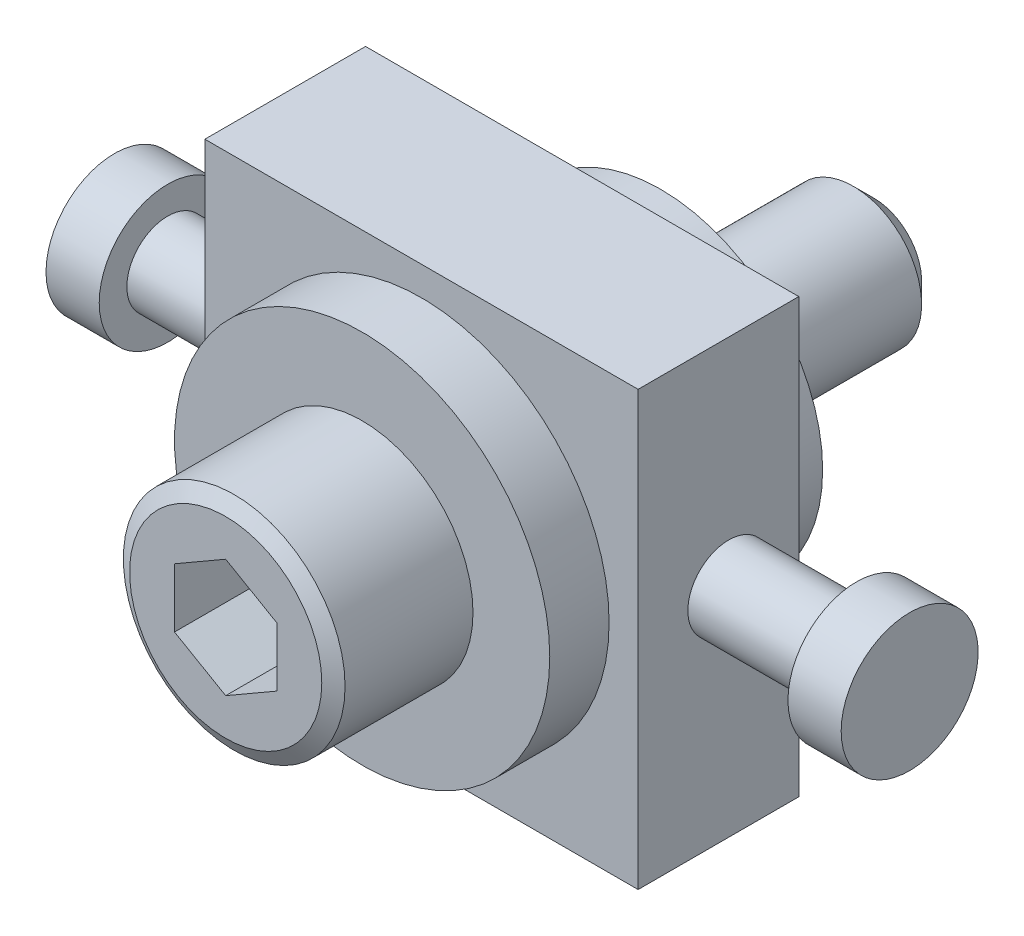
ISO-10303-21;
HEADER;
FILE_DESCRIPTION(('STEP AP214'),'2;1');
FILE_NAME('part.step','',(''),(''),'','','');
FILE_SCHEMA(('AUTOMOTIVE_DESIGN { 1 0 10303 214 1 1 1 1 }'));
ENDSEC;
DATA;
#1=APPLICATION_CONTEXT('core data for automotive mechanical design processes');
#2=APPLICATION_PROTOCOL_DEFINITION('international standard','automotive_design',2000,#1);
#3=PRODUCT_CONTEXT('',#1,'mechanical');
#4=PRODUCT('Part','Part','',(#3));
#5=PRODUCT_RELATED_PRODUCT_CATEGORY('part','',(#4));
#6=PRODUCT_DEFINITION_FORMATION('','',#4);
#7=PRODUCT_DEFINITION_CONTEXT('part definition',#1,'design');
#8=PRODUCT_DEFINITION('design','',#6,#7);
#9=PRODUCT_DEFINITION_SHAPE('','',#8);
#10=(LENGTH_UNIT() NAMED_UNIT(*) SI_UNIT(.MILLI.,.METRE.));
#11=(NAMED_UNIT(*) PLANE_ANGLE_UNIT() SI_UNIT($,.RADIAN.));
#12=(NAMED_UNIT(*) SI_UNIT($,.STERADIAN.) SOLID_ANGLE_UNIT());
#13=UNCERTAINTY_MEASURE_WITH_UNIT(LENGTH_MEASURE(1.E-05),#10,'distance_accuracy_value','');
#14=(GEOMETRIC_REPRESENTATION_CONTEXT(3) GLOBAL_UNCERTAINTY_ASSIGNED_CONTEXT((#13)) GLOBAL_UNIT_ASSIGNED_CONTEXT((#10,
#11,#12)) REPRESENTATION_CONTEXT('',''));
#15=CARTESIAN_POINT('',(0.,0.,0.));
#16=DIRECTION('',(0.,0.,1.));
#17=DIRECTION('',(1.,0.,0.));
#18=AXIS2_PLACEMENT_3D('',#15,#16,#17);
#19=CARTESIAN_POINT('',(20.19,0.,8.71));
#20=DIRECTION('',(1.,0.,0.));
#21=DIRECTION('',(0.,0.,1.));
#22=AXIS2_PLACEMENT_3D('',#19,#20,#21);
#23=PLANE('',#22);
#24=CARTESIAN_POINT('',(20.19,0.,8.71));
#25=DIRECTION('',(1.,0.,0.));
#26=DIRECTION('',(0.,1.,0.));
#27=AXIS2_PLACEMENT_3D('',#24,#25,#26);
#28=CIRCLE('',#27,2.395);
#29=CARTESIAN_POINT('',(20.19,2.395,8.71));
#30=VERTEX_POINT('',#29);
#31=EDGE_CURVE('E87',#30,#30,#28,.F.);
#32=ORIENTED_EDGE('',*,*,#31,.F.);
#33=EDGE_LOOP('',(#32));
#34=FACE_BOUND('',#33,.T.);
#35=CARTESIAN_POINT('',(20.19,0.,8.71));
#36=DIRECTION('',(1.,0.,0.));
#37=DIRECTION('',(0.,0.,1.));
#38=AXIS2_PLACEMENT_3D('',#35,#36,#37);
#39=CIRCLE('',#38,4.015);
#40=CARTESIAN_POINT('',(20.19,0.,12.725));
#41=VERTEX_POINT('',#40);
#42=EDGE_CURVE('E9',#41,#41,#39,.T.);
#43=ORIENTED_EDGE('',*,*,#42,.F.);
#44=EDGE_LOOP('',(#43));
#45=FACE_BOUND('',#44,.T.);
#46=ADVANCED_FACE('F14',(#34,#45),#23,.F.);
#47=CARTESIAN_POINT('',(20.7,0.,8.71));
#48=DIRECTION('',(-1.,0.,0.));
#49=DIRECTION('',(0.,0.,1.));
#50=AXIS2_PLACEMENT_3D('',#47,#48,#49);
#51=CYLINDRICAL_SURFACE('',#50,2.395);
#52=CARTESIAN_POINT('',(12.7,0.,8.71));
#53=DIRECTION('',(1.,0.,0.));
#54=DIRECTION('',(0.,0.,-1.));
#55=AXIS2_PLACEMENT_3D('',#52,#53,#54);
#56=CIRCLE('',#55,2.395);
#57=CARTESIAN_POINT('',(12.7,0.,6.315));
#58=VERTEX_POINT('',#57);
#59=EDGE_CURVE('E144',#58,#58,#56,.T.);
#60=ORIENTED_EDGE('',*,*,#59,.T.);
#61=EDGE_LOOP('',(#60));
#62=FACE_BOUND('',#61,.T.);
#63=ORIENTED_EDGE('',*,*,#31,.T.);
#64=EDGE_LOOP('',(#63));
#65=FACE_BOUND('',#64,.T.);
#66=ADVANCED_FACE('F171',(#62,#65),#51,.T.);
#67=CARTESIAN_POINT('',(-20.7,0.,8.71));
#68=DIRECTION('',(1.,0.,0.));
#69=DIRECTION('',(0.,0.,-1.));
#70=AXIS2_PLACEMENT_3D('',#67,#68,#69);
#71=CYLINDRICAL_SURFACE('',#70,2.395);
#72=CARTESIAN_POINT('',(-12.7,0.,8.71));
#73=DIRECTION('',(1.,0.,0.));
#74=DIRECTION('',(0.,0.,-1.));
#75=AXIS2_PLACEMENT_3D('',#72,#73,#74);
#76=CIRCLE('',#75,2.395);
#77=CARTESIAN_POINT('',(-12.7,0.,6.315));
#78=VERTEX_POINT('',#77);
#79=EDGE_CURVE('E76',#78,#78,#76,.T.);
#80=ORIENTED_EDGE('',*,*,#79,.F.);
#81=EDGE_LOOP('',(#80));
#82=FACE_BOUND('',#81,.T.);
#83=CARTESIAN_POINT('',(-20.19,0.,8.71));
#84=DIRECTION('',(-1.,0.,0.));
#85=DIRECTION('',(0.,-1.,0.));
#86=AXIS2_PLACEMENT_3D('',#83,#84,#85);
#87=CIRCLE('',#86,2.395);
#88=CARTESIAN_POINT('',(-20.19,-2.395,8.71));
#89=VERTEX_POINT('',#88);
#90=EDGE_CURVE('E134',#89,#89,#87,.T.);
#91=ORIENTED_EDGE('',*,*,#90,.F.);
#92=EDGE_LOOP('',(#91));
#93=FACE_BOUND('',#92,.T.);
#94=ADVANCED_FACE('F177',(#82,#93),#71,.T.);
#95=CARTESIAN_POINT('',(-12.7,12.7,-150.));
#96=DIRECTION('',(-1.,0.,0.));
#97=DIRECTION('',(0.,-1.,0.));
#98=AXIS2_PLACEMENT_3D('',#95,#96,#97);
#99=PLANE('',#98);
#100=DIRECTION('',(0.,-1.,0.));
#101=VECTOR('',#100,1.);
#102=CARTESIAN_POINT('',(-12.7,0.,4.6));
#103=LINE('',#102,#101);
#104=CARTESIAN_POINT('',(-12.7,12.7,4.6));
#105=VERTEX_POINT('',#104);
#106=CARTESIAN_POINT('',(-12.7,-12.7,4.6));
#107=VERTEX_POINT('',#106);
#108=EDGE_CURVE('E77',#105,#107,#103,.T.);
#109=ORIENTED_EDGE('',*,*,#108,.T.);
#110=DIRECTION('',(0.,0.,1.));
#111=VECTOR('',#110,1.);
#112=CARTESIAN_POINT('',(-12.7,-12.7,-150.));
#113=LINE('',#112,#111);
#114=CARTESIAN_POINT('',(-12.7,-12.7,14.02));
#115=VERTEX_POINT('',#114);
#116=EDGE_CURVE('E66',#107,#115,#113,.T.);
#117=ORIENTED_EDGE('',*,*,#116,.T.);
#118=DIRECTION('',(0.,-1.,0.));
#119=VECTOR('',#118,1.);
#120=CARTESIAN_POINT('',(-12.7,0.,14.02));
#121=LINE('',#120,#119);
#122=CARTESIAN_POINT('',(-12.7,12.7,14.02));
#123=VERTEX_POINT('',#122);
#124=EDGE_CURVE('E118',#123,#115,#121,.T.);
#125=ORIENTED_EDGE('',*,*,#124,.F.);
#126=DIRECTION('',(0.,0.,1.));
#127=VECTOR('',#126,1.);
#128=CARTESIAN_POINT('',(-12.7,12.7,-150.));
#129=LINE('',#128,#127);
#130=EDGE_CURVE('E84',#105,#123,#129,.T.);
#131=ORIENTED_EDGE('',*,*,#130,.F.);
#132=EDGE_LOOP('',(#109,#117,#125,#131));
#133=FACE_BOUND('',#132,.T.);
#134=ORIENTED_EDGE('',*,*,#79,.T.);
#135=EDGE_LOOP('',(#134));
#136=FACE_BOUND('',#135,.T.);
#137=ADVANCED_FACE('F81',(#133,#136),#99,.T.);
#138=CARTESIAN_POINT('',(0.,0.,4.6));
#139=DIRECTION('',(0.,0.,1.));
#140=DIRECTION('',(1.,0.,0.));
#141=AXIS2_PLACEMENT_3D('',#138,#139,#140);
#142=PLANE('',#141);
#143=CARTESIAN_POINT('',(0.,0.,4.6));
#144=DIRECTION('',(0.,0.,1.));
#145=DIRECTION('',(1.,0.,0.));
#146=AXIS2_PLACEMENT_3D('',#143,#144,#145);
#147=CIRCLE('',#146,9.5);
#148=CARTESIAN_POINT('',(9.5,0.,4.6));
#149=VERTEX_POINT('',#148);
#150=EDGE_CURVE('E98',#149,#149,#147,.T.);
#151=ORIENTED_EDGE('',*,*,#150,.T.);
#152=EDGE_LOOP('',(#151));
#153=FACE_BOUND('',#152,.T.);
#154=ORIENTED_EDGE('',*,*,#108,.F.);
#155=DIRECTION('',(1.,0.,0.));
#156=VECTOR('',#155,1.);
#157=CARTESIAN_POINT('',(0.,12.7,4.6));
#158=LINE('',#157,#156);
#159=CARTESIAN_POINT('',(12.7,12.7,4.6));
#160=VERTEX_POINT('',#159);
#161=EDGE_CURVE('E93',#105,#160,#158,.T.);
#162=ORIENTED_EDGE('',*,*,#161,.T.);
#163=DIRECTION('',(0.,1.,0.));
#164=VECTOR('',#163,1.);
#165=CARTESIAN_POINT('',(12.7,0.,4.6));
#166=LINE('',#165,#164);
#167=CARTESIAN_POINT('',(12.7,-12.7,4.6));
#168=VERTEX_POINT('',#167);
#169=EDGE_CURVE('E91',#168,#160,#166,.T.);
#170=ORIENTED_EDGE('',*,*,#169,.F.);
#171=DIRECTION('',(-1.,0.,0.));
#172=VECTOR('',#171,1.);
#173=CARTESIAN_POINT('',(0.,-12.7,4.6));
#174=LINE('',#173,#172);
#175=EDGE_CURVE('E70',#168,#107,#174,.T.);
#176=ORIENTED_EDGE('',*,*,#175,.T.);
#177=EDGE_LOOP('',(#154,#162,#170,#176));
#178=FACE_BOUND('',#177,.T.);
#179=ADVANCED_FACE('F90',(#153,#178),#142,.F.);
#180=CARTESIAN_POINT('',(0.,0.,0.));
#181=DIRECTION('',(0.,0.,1.));
#182=DIRECTION('',(1.,0.,0.));
#183=AXIS2_PLACEMENT_3D('',#180,#181,#182);
#184=PLANE('',#183);
#185=CARTESIAN_POINT('',(0.,0.,0.));
#186=DIRECTION('',(0.,0.,1.));
#187=DIRECTION('',(1.,0.,0.));
#188=AXIS2_PLACEMENT_3D('',#185,#186,#187);
#189=CIRCLE('',#188,9.5);
#190=CARTESIAN_POINT('',(9.5,0.,0.));
#191=VERTEX_POINT('',#190);
#192=EDGE_CURVE('E92',#191,#191,#189,.T.);
#193=ORIENTED_EDGE('',*,*,#192,.F.);
#194=EDGE_LOOP('',(#193));
#195=FACE_BOUND('',#194,.T.);
#196=CARTESIAN_POINT('',(0.,0.,0.));
#197=DIRECTION('',(0.,0.,-1.));
#198=DIRECTION('',(-1.,0.,0.));
#199=AXIS2_PLACEMENT_3D('',#196,#197,#198);
#200=CIRCLE('',#199,4.);
#201=CARTESIAN_POINT('',(-4.,0.,0.));
#202=VERTEX_POINT('',#201);
#203=EDGE_CURVE('E106',#202,#202,#200,.T.);
#204=ORIENTED_EDGE('',*,*,#203,.F.);
#205=EDGE_LOOP('',(#204));
#206=FACE_BOUND('',#205,.T.);
#207=ADVANCED_FACE('F228',(#195,#206),#184,.F.);
#208=CARTESIAN_POINT('',(0.,0.,4.6));
#209=DIRECTION('',(0.,0.,-1.));
#210=DIRECTION('',(-1.,0.,0.));
#211=AXIS2_PLACEMENT_3D('',#208,#209,#210);
#212=CYLINDRICAL_SURFACE('',#211,9.5);
#213=ORIENTED_EDGE('',*,*,#150,.F.);
#214=EDGE_LOOP('',(#213));
#215=FACE_BOUND('',#214,.T.);
#216=ORIENTED_EDGE('',*,*,#192,.T.);
#217=EDGE_LOOP('',(#216));
#218=FACE_BOUND('',#217,.T.);
#219=ADVANCED_FACE('F217',(#215,#218),#212,.T.);
#220=CARTESIAN_POINT('',(0.,0.,-12.5));
#221=DIRECTION('',(0.,0.,1.));
#222=DIRECTION('',(1.,0.,0.));
#223=AXIS2_PLACEMENT_3D('',#220,#221,#222);
#224=CYLINDRICAL_SURFACE('',#223,4.);
#225=CARTESIAN_POINT('',(0.,0.,-11.3));
#226=DIRECTION('',(0.,0.,-1.));
#227=DIRECTION('',(-1.,0.,0.));
#228=AXIS2_PLACEMENT_3D('',#225,#226,#227);
#229=CIRCLE('',#228,4.);
#230=CARTESIAN_POINT('',(-4.,0.,-11.3));
#231=VERTEX_POINT('',#230);
#232=EDGE_CURVE('E96',#231,#231,#229,.F.);
#233=ORIENTED_EDGE('',*,*,#232,.T.);
#234=EDGE_LOOP('',(#233));
#235=FACE_BOUND('',#234,.T.);
#236=ORIENTED_EDGE('',*,*,#203,.T.);
#237=EDGE_LOOP('',(#236));
#238=FACE_BOUND('',#237,.T.);
#239=ADVANCED_FACE('F215',(#235,#238),#224,.T.);
#240=CARTESIAN_POINT('',(0.,0.,-12.5));
#241=DIRECTION('',(0.,0.,-1.));
#242=DIRECTION('',(-1.,0.,0.));
#243=AXIS2_PLACEMENT_3D('',#240,#241,#242);
#244=PLANE('',#243);
#245=CARTESIAN_POINT('',(0.,0.,-12.5));
#246=DIRECTION('',(0.,0.,-1.));
#247=DIRECTION('',(-1.,0.,0.));
#248=AXIS2_PLACEMENT_3D('',#245,#246,#247);
#249=CIRCLE('',#248,2.8);
#250=CARTESIAN_POINT('',(-2.8,0.,-12.5));
#251=VERTEX_POINT('',#250);
#252=EDGE_CURVE('E109',#251,#251,#249,.T.);
#253=ORIENTED_EDGE('',*,*,#252,.T.);
#254=EDGE_LOOP('',(#253));
#255=FACE_BOUND('',#254,.T.);
#256=ADVANCED_FACE('F212',(#255),#244,.T.);
#257=CARTESIAN_POINT('',(-12.7,12.7,-150.));
#258=DIRECTION('',(0.,-1.,0.));
#259=DIRECTION('',(1.,0.,0.));
#260=AXIS2_PLACEMENT_3D('',#257,#258,#259);
#261=PLANE('',#260);
#262=ORIENTED_EDGE('',*,*,#130,.T.);
#263=DIRECTION('',(1.,0.,0.));
#264=VECTOR('',#263,1.);
#265=CARTESIAN_POINT('',(0.,12.7,14.02));
#266=LINE('',#265,#264);
#267=CARTESIAN_POINT('',(12.7,12.7,14.02));
#268=VERTEX_POINT('',#267);
#269=EDGE_CURVE('E104',#123,#268,#266,.T.);
#270=ORIENTED_EDGE('',*,*,#269,.T.);
#271=DIRECTION('',(0.,0.,1.));
#272=VECTOR('',#271,1.);
#273=CARTESIAN_POINT('',(12.7,12.7,-150.));
#274=LINE('',#273,#272);
#275=EDGE_CURVE('E103',#160,#268,#274,.T.);
#276=ORIENTED_EDGE('',*,*,#275,.F.);
#277=ORIENTED_EDGE('',*,*,#161,.F.);
#278=EDGE_LOOP('',(#262,#270,#276,#277));
#279=FACE_BOUND('',#278,.T.);
#280=ADVANCED_FACE('F214',(#279),#261,.F.);
#281=CARTESIAN_POINT('',(12.7,-12.7,-150.));
#282=DIRECTION('',(1.,0.,0.));
#283=DIRECTION('',(0.,0.,-1.));
#284=AXIS2_PLACEMENT_3D('',#281,#282,#283);
#285=PLANE('',#284);
#286=ORIENTED_EDGE('',*,*,#59,.F.);
#287=EDGE_LOOP('',(#286));
#288=FACE_BOUND('',#287,.T.);
#289=ORIENTED_EDGE('',*,*,#169,.T.);
#290=ORIENTED_EDGE('',*,*,#275,.T.);
#291=DIRECTION('',(0.,1.,0.));
#292=VECTOR('',#291,1.);
#293=CARTESIAN_POINT('',(12.7,0.,14.02));
#294=LINE('',#293,#292);
#295=CARTESIAN_POINT('',(12.7,-12.7,14.02));
#296=VERTEX_POINT('',#295);
#297=EDGE_CURVE('E125',#296,#268,#294,.T.);
#298=ORIENTED_EDGE('',*,*,#297,.F.);
#299=DIRECTION('',(0.,0.,1.));
#300=VECTOR('',#299,1.);
#301=CARTESIAN_POINT('',(12.7,-12.7,-150.));
#302=LINE('',#301,#300);
#303=EDGE_CURVE('E124',#168,#296,#302,.T.);
#304=ORIENTED_EDGE('',*,*,#303,.F.);
#305=EDGE_LOOP('',(#289,#290,#298,#304));
#306=FACE_BOUND('',#305,.T.);
#307=ADVANCED_FACE('F222',(#288,#306),#285,.T.);
#308=CARTESIAN_POINT('',(12.7,-12.7,-150.));
#309=DIRECTION('',(0.,1.,0.));
#310=DIRECTION('',(-1.,0.,0.));
#311=AXIS2_PLACEMENT_3D('',#308,#309,#310);
#312=PLANE('',#311);
#313=ORIENTED_EDGE('',*,*,#303,.T.);
#314=DIRECTION('',(-1.,0.,0.));
#315=VECTOR('',#314,1.);
#316=CARTESIAN_POINT('',(0.,-12.7,14.02));
#317=LINE('',#316,#315);
#318=EDGE_CURVE('E73',#296,#115,#317,.T.);
#319=ORIENTED_EDGE('',*,*,#318,.T.);
#320=ORIENTED_EDGE('',*,*,#116,.F.);
#321=ORIENTED_EDGE('',*,*,#175,.F.);
#322=EDGE_LOOP('',(#313,#319,#320,#321));
#323=FACE_BOUND('',#322,.T.);
#324=ADVANCED_FACE('F68',(#323),#312,.F.);
#325=CARTESIAN_POINT('',(0.,0.,25.5));
#326=DIRECTION('',(0.,0.,-1.));
#327=DIRECTION('',(-1.,0.,0.));
#328=AXIS2_PLACEMENT_3D('',#325,#326,#327);
#329=CYLINDRICAL_SURFACE('',#328,6.5);
#330=CARTESIAN_POINT('',(0.,0.,25.));
#331=DIRECTION('',(0.,0.,1.));
#332=DIRECTION('',(1.,0.,0.));
#333=AXIS2_PLACEMENT_3D('',#330,#331,#332);
#334=CIRCLE('',#333,6.5);
#335=CARTESIAN_POINT('',(6.5,0.,25.));
#336=VERTEX_POINT('',#335);
#337=EDGE_CURVE('E114',#336,#336,#334,.F.);
#338=ORIENTED_EDGE('',*,*,#337,.T.);
#339=EDGE_LOOP('',(#338));
#340=FACE_BOUND('',#339,.T.);
#341=CARTESIAN_POINT('',(0.,0.,17.5));
#342=DIRECTION('',(0.,0.,1.));
#343=DIRECTION('',(1.,0.,0.));
#344=AXIS2_PLACEMENT_3D('',#341,#342,#343);
#345=CIRCLE('',#344,6.5);
#346=CARTESIAN_POINT('',(6.5,0.,17.5));
#347=VERTEX_POINT('',#346);
#348=EDGE_CURVE('E110',#347,#347,#345,.T.);
#349=ORIENTED_EDGE('',*,*,#348,.T.);
#350=EDGE_LOOP('',(#349));
#351=FACE_BOUND('',#350,.T.);
#352=ADVANCED_FACE('F151',(#340,#351),#329,.T.);
#353=CARTESIAN_POINT('',(0.,0.,17.5));
#354=DIRECTION('',(0.,0.,1.));
#355=DIRECTION('',(1.,0.,0.));
#356=AXIS2_PLACEMENT_3D('',#353,#354,#355);
#357=PLANE('',#356);
#358=ORIENTED_EDGE('',*,*,#348,.F.);
#359=EDGE_LOOP('',(#358));
#360=FACE_BOUND('',#359,.T.);
#361=CARTESIAN_POINT('',(0.,0.,17.5));
#362=DIRECTION('',(0.,0.,1.));
#363=DIRECTION('',(1.,0.,0.));
#364=AXIS2_PLACEMENT_3D('',#361,#362,#363);
#365=CIRCLE('',#364,11.);
#366=CARTESIAN_POINT('',(11.,0.,17.5));
#367=VERTEX_POINT('',#366);
#368=EDGE_CURVE('E113',#367,#367,#365,.T.);
#369=ORIENTED_EDGE('',*,*,#368,.T.);
#370=EDGE_LOOP('',(#369));
#371=FACE_BOUND('',#370,.T.);
#372=ADVANCED_FACE('F538',(#360,#371),#357,.T.);
#373=CARTESIAN_POINT('',(0.,0.,17.5));
#374=DIRECTION('',(0.,0.,-1.));
#375=DIRECTION('',(-1.,0.,0.));
#376=AXIS2_PLACEMENT_3D('',#373,#374,#375);
#377=CYLINDRICAL_SURFACE('',#376,11.);
#378=ORIENTED_EDGE('',*,*,#368,.F.);
#379=EDGE_LOOP('',(#378));
#380=FACE_BOUND('',#379,.T.);
#381=CARTESIAN_POINT('',(0.,0.,14.02));
#382=DIRECTION('',(0.,0.,1.));
#383=DIRECTION('',(1.,0.,0.));
#384=AXIS2_PLACEMENT_3D('',#381,#382,#383);
#385=CIRCLE('',#384,11.);
#386=CARTESIAN_POINT('',(11.,0.,14.02));
#387=VERTEX_POINT('',#386);
#388=EDGE_CURVE('E115',#387,#387,#385,.T.);
#389=ORIENTED_EDGE('',*,*,#388,.T.);
#390=EDGE_LOOP('',(#389));
#391=FACE_BOUND('',#390,.T.);
#392=ADVANCED_FACE('F205',(#380,#391),#377,.T.);
#393=CARTESIAN_POINT('',(0.,0.,14.02));
#394=DIRECTION('',(0.,0.,1.));
#395=DIRECTION('',(1.,0.,0.));
#396=AXIS2_PLACEMENT_3D('',#393,#394,#395);
#397=PLANE('',#396);
#398=ORIENTED_EDGE('',*,*,#388,.F.);
#399=EDGE_LOOP('',(#398));
#400=FACE_BOUND('',#399,.T.);
#401=ORIENTED_EDGE('',*,*,#269,.F.);
#402=ORIENTED_EDGE('',*,*,#124,.T.);
#403=ORIENTED_EDGE('',*,*,#318,.F.);
#404=ORIENTED_EDGE('',*,*,#297,.T.);
#405=EDGE_LOOP('',(#401,#402,#403,#404));
#406=FACE_BOUND('',#405,.T.);
#407=ADVANCED_FACE('F196',(#400,#406),#397,.T.);
#408=CARTESIAN_POINT('',(0.,0.,-12.5));
#409=DIRECTION('',(0.,0.,1.));
#410=DIRECTION('',(1.,0.,0.));
#411=AXIS2_PLACEMENT_3D('',#408,#409,#410);
#412=CONICAL_SURFACE('',#411,2.8,0.785398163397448);
#413=ORIENTED_EDGE('',*,*,#232,.F.);
#414=EDGE_LOOP('',(#413));
#415=FACE_BOUND('',#414,.T.);
#416=ORIENTED_EDGE('',*,*,#252,.F.);
#417=EDGE_LOOP('',(#416));
#418=FACE_BOUND('',#417,.T.);
#419=ADVANCED_FACE('F193',(#415,#418),#412,.T.);
#420=CARTESIAN_POINT('',(0.,3.46410161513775,20.5));
#421=DIRECTION('',(0.,0.,1.));
#422=DIRECTION('',(1.,0.,0.));
#423=AXIS2_PLACEMENT_3D('',#420,#421,#422);
#424=PLANE('',#423);
#425=DIRECTION('',(-0.866025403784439,0.5,0.));
#426=VECTOR('',#425,1.);
#427=CARTESIAN_POINT('',(3.,1.73205080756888,20.5));
#428=LINE('',#427,#426);
#429=CARTESIAN_POINT('',(3.,1.73205080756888,20.5));
#430=VERTEX_POINT('',#429);
#431=CARTESIAN_POINT('',(0.,3.46410161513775,20.5));
#432=VERTEX_POINT('',#431);
#433=EDGE_CURVE('E128',#430,#432,#428,.T.);
#434=ORIENTED_EDGE('',*,*,#433,.T.);
#435=DIRECTION('',(-0.866025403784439,-0.5,0.));
#436=VECTOR('',#435,1.);
#437=CARTESIAN_POINT('',(0.,3.46410161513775,20.5));
#438=LINE('',#437,#436);
#439=CARTESIAN_POINT('',(-3.,1.73205080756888,20.5));
#440=VERTEX_POINT('',#439);
#441=EDGE_CURVE('E323',#432,#440,#438,.T.);
#442=ORIENTED_EDGE('',*,*,#441,.T.);
#443=DIRECTION('',(0.,-1.,0.));
#444=VECTOR('',#443,1.);
#445=CARTESIAN_POINT('',(-3.,1.73205080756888,20.5));
#446=LINE('',#445,#444);
#447=CARTESIAN_POINT('',(-3.,-1.73205080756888,20.5));
#448=VERTEX_POINT('',#447);
#449=EDGE_CURVE('E320',#440,#448,#446,.T.);
#450=ORIENTED_EDGE('',*,*,#449,.T.);
#451=DIRECTION('',(0.866025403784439,-0.5,0.));
#452=VECTOR('',#451,1.);
#453=CARTESIAN_POINT('',(-3.,-1.73205080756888,20.5));
#454=LINE('',#453,#452);
#455=CARTESIAN_POINT('',(0.,-3.46410161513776,20.5));
#456=VERTEX_POINT('',#455);
#457=EDGE_CURVE('E317',#448,#456,#454,.T.);
#458=ORIENTED_EDGE('',*,*,#457,.T.);
#459=DIRECTION('',(0.866025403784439,0.5,0.));
#460=VECTOR('',#459,1.);
#461=CARTESIAN_POINT('',(0.,-3.46410161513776,20.5));
#462=LINE('',#461,#460);
#463=CARTESIAN_POINT('',(3.,-1.73205080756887,20.5));
#464=VERTEX_POINT('',#463);
#465=EDGE_CURVE('E314',#456,#464,#462,.T.);
#466=ORIENTED_EDGE('',*,*,#465,.T.);
#467=DIRECTION('',(0.,1.,0.));
#468=VECTOR('',#467,1.);
#469=CARTESIAN_POINT('',(3.,-1.73205080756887,20.5));
#470=LINE('',#469,#468);
#471=EDGE_CURVE('E310',#464,#430,#470,.T.);
#472=ORIENTED_EDGE('',*,*,#471,.T.);
#473=EDGE_LOOP('',(#434,#442,#450,#458,#466,#472));
#474=FACE_BOUND('',#473,.T.);
#475=ADVANCED_FACE('F195',(#474),#424,.T.);
#476=CARTESIAN_POINT('',(0.,3.46410161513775,20.5));
#477=DIRECTION('',(-0.5,0.866025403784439,0.));
#478=DIRECTION('',(-0.866025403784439,-0.5,0.));
#479=AXIS2_PLACEMENT_3D('',#476,#477,#478);
#480=PLANE('',#479);
#481=DIRECTION('',(-0.866025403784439,-0.5,0.));
#482=VECTOR('',#481,1.);
#483=CARTESIAN_POINT('',(0.,3.46410161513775,25.5));
#484=LINE('',#483,#482);
#485=CARTESIAN_POINT('',(0.,3.46410161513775,25.5));
#486=VERTEX_POINT('',#485);
#487=CARTESIAN_POINT('',(-3.,1.73205080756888,25.5));
#488=VERTEX_POINT('',#487);
#489=EDGE_CURVE('E283',#486,#488,#484,.T.);
#490=ORIENTED_EDGE('',*,*,#489,.T.);
#491=DIRECTION('',(0.,0.,1.));
#492=VECTOR('',#491,1.);
#493=CARTESIAN_POINT('',(-3.,1.73205080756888,20.5));
#494=LINE('',#493,#492);
#495=EDGE_CURVE('E284',#440,#488,#494,.T.);
#496=ORIENTED_EDGE('',*,*,#495,.F.);
#497=ORIENTED_EDGE('',*,*,#441,.F.);
#498=DIRECTION('',(0.,0.,1.));
#499=VECTOR('',#498,1.);
#500=CARTESIAN_POINT('',(0.,3.46410161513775,20.5));
#501=LINE('',#500,#499);
#502=EDGE_CURVE('E279',#432,#486,#501,.T.);
#503=ORIENTED_EDGE('',*,*,#502,.T.);
#504=EDGE_LOOP('',(#490,#496,#497,#503));
#505=FACE_BOUND('',#504,.T.);
#506=ADVANCED_FACE('F202',(#505),#480,.F.);
#507=CARTESIAN_POINT('',(-3.,1.73205080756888,20.5));
#508=DIRECTION('',(-1.,0.,0.));
#509=DIRECTION('',(0.,-1.,0.));
#510=AXIS2_PLACEMENT_3D('',#507,#508,#509);
#511=PLANE('',#510);
#512=DIRECTION('',(0.,-1.,0.));
#513=VECTOR('',#512,1.);
#514=CARTESIAN_POINT('',(-3.,1.73205080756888,25.5));
#515=LINE('',#514,#513);
#516=CARTESIAN_POINT('',(-3.,-1.73205080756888,25.5));
#517=VERTEX_POINT('',#516);
#518=EDGE_CURVE('E282',#488,#517,#515,.T.);
#519=ORIENTED_EDGE('',*,*,#518,.T.);
#520=DIRECTION('',(0.,0.,1.));
#521=VECTOR('',#520,1.);
#522=CARTESIAN_POINT('',(-3.,-1.73205080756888,20.5));
#523=LINE('',#522,#521);
#524=EDGE_CURVE('E288',#448,#517,#523,.T.);
#525=ORIENTED_EDGE('',*,*,#524,.F.);
#526=ORIENTED_EDGE('',*,*,#449,.F.);
#527=ORIENTED_EDGE('',*,*,#495,.T.);
#528=EDGE_LOOP('',(#519,#525,#526,#527));
#529=FACE_BOUND('',#528,.T.);
#530=ADVANCED_FACE('F356',(#529),#511,.F.);
#531=CARTESIAN_POINT('',(-3.,-1.73205080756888,20.5));
#532=DIRECTION('',(-0.5,-0.866025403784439,0.));
#533=DIRECTION('',(0.866025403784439,-0.5,0.));
#534=AXIS2_PLACEMENT_3D('',#531,#532,#533);
#535=PLANE('',#534);
#536=DIRECTION('',(0.866025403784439,-0.5,0.));
#537=VECTOR('',#536,1.);
#538=CARTESIAN_POINT('',(-3.,-1.73205080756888,25.5));
#539=LINE('',#538,#537);
#540=CARTESIAN_POINT('',(0.,-3.46410161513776,25.5));
#541=VERTEX_POINT('',#540);
#542=EDGE_CURVE('E287',#517,#541,#539,.T.);
#543=ORIENTED_EDGE('',*,*,#542,.T.);
#544=DIRECTION('',(0.,0.,1.));
#545=VECTOR('',#544,1.);
#546=CARTESIAN_POINT('',(0.,-3.46410161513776,20.5));
#547=LINE('',#546,#545);
#548=EDGE_CURVE('E292',#456,#541,#547,.T.);
#549=ORIENTED_EDGE('',*,*,#548,.F.);
#550=ORIENTED_EDGE('',*,*,#457,.F.);
#551=ORIENTED_EDGE('',*,*,#524,.T.);
#552=EDGE_LOOP('',(#543,#549,#550,#551));
#553=FACE_BOUND('',#552,.T.);
#554=ADVANCED_FACE('F357',(#553),#535,.F.);
#555=CARTESIAN_POINT('',(0.,-3.46410161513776,20.5));
#556=DIRECTION('',(0.5,-0.866025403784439,0.));
#557=DIRECTION('',(0.866025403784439,0.5,0.));
#558=AXIS2_PLACEMENT_3D('',#555,#556,#557);
#559=PLANE('',#558);
#560=DIRECTION('',(0.866025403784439,0.5,0.));
#561=VECTOR('',#560,1.);
#562=CARTESIAN_POINT('',(0.,-3.46410161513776,25.5));
#563=LINE('',#562,#561);
#564=CARTESIAN_POINT('',(3.,-1.73205080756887,25.5));
#565=VERTEX_POINT('',#564);
#566=EDGE_CURVE('E291',#541,#565,#563,.T.);
#567=ORIENTED_EDGE('',*,*,#566,.T.);
#568=DIRECTION('',(0.,0.,1.));
#569=VECTOR('',#568,1.);
#570=CARTESIAN_POINT('',(3.,-1.73205080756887,20.5));
#571=LINE('',#570,#569);
#572=EDGE_CURVE('E296',#464,#565,#571,.T.);
#573=ORIENTED_EDGE('',*,*,#572,.F.);
#574=ORIENTED_EDGE('',*,*,#465,.F.);
#575=ORIENTED_EDGE('',*,*,#548,.T.);
#576=EDGE_LOOP('',(#567,#573,#574,#575));
#577=FACE_BOUND('',#576,.T.);
#578=ADVANCED_FACE('F361',(#577),#559,.F.);
#579=CARTESIAN_POINT('',(3.,-1.73205080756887,20.5));
#580=DIRECTION('',(1.,0.,0.));
#581=DIRECTION('',(0.,1.,0.));
#582=AXIS2_PLACEMENT_3D('',#579,#580,#581);
#583=PLANE('',#582);
#584=DIRECTION('',(0.,1.,0.));
#585=VECTOR('',#584,1.);
#586=CARTESIAN_POINT('',(3.,-1.73205080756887,25.5));
#587=LINE('',#586,#585);
#588=CARTESIAN_POINT('',(3.,1.73205080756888,25.5));
#589=VERTEX_POINT('',#588);
#590=EDGE_CURVE('E295',#565,#589,#587,.T.);
#591=ORIENTED_EDGE('',*,*,#590,.T.);
#592=DIRECTION('',(0.,0.,1.));
#593=VECTOR('',#592,1.);
#594=CARTESIAN_POINT('',(3.,1.73205080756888,20.5));
#595=LINE('',#594,#593);
#596=EDGE_CURVE('E33',#430,#589,#595,.T.);
#597=ORIENTED_EDGE('',*,*,#596,.F.);
#598=ORIENTED_EDGE('',*,*,#471,.F.);
#599=ORIENTED_EDGE('',*,*,#572,.T.);
#600=EDGE_LOOP('',(#591,#597,#598,#599));
#601=FACE_BOUND('',#600,.T.);
#602=ADVANCED_FACE('F367',(#601),#583,.F.);
#603=CARTESIAN_POINT('',(3.,1.73205080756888,20.5));
#604=DIRECTION('',(0.5,0.866025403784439,0.));
#605=DIRECTION('',(-0.866025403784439,0.5,0.));
#606=AXIS2_PLACEMENT_3D('',#603,#604,#605);
#607=PLANE('',#606);
#608=DIRECTION('',(-0.866025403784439,0.5,0.));
#609=VECTOR('',#608,1.);
#610=CARTESIAN_POINT('',(3.,1.73205080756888,25.5));
#611=LINE('',#610,#609);
#612=EDGE_CURVE('E299',#589,#486,#611,.T.);
#613=ORIENTED_EDGE('',*,*,#612,.T.);
#614=ORIENTED_EDGE('',*,*,#502,.F.);
#615=ORIENTED_EDGE('',*,*,#433,.F.);
#616=ORIENTED_EDGE('',*,*,#596,.T.);
#617=EDGE_LOOP('',(#613,#614,#615,#616));
#618=FACE_BOUND('',#617,.T.);
#619=ADVANCED_FACE('F166',(#618),#607,.F.);
#620=CARTESIAN_POINT('',(0.,0.,25.5));
#621=DIRECTION('',(0.,0.,1.));
#622=DIRECTION('',(1.,0.,0.));
#623=AXIS2_PLACEMENT_3D('',#620,#621,#622);
#624=PLANE('',#623);
#625=CARTESIAN_POINT('',(0.,0.,25.5));
#626=DIRECTION('',(0.,0.,1.));
#627=DIRECTION('',(1.,0.,0.));
#628=AXIS2_PLACEMENT_3D('',#625,#626,#627);
#629=CIRCLE('',#628,5.63397459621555);
#630=CARTESIAN_POINT('',(5.63397459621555,0.,25.5));
#631=VERTEX_POINT('',#630);
#632=EDGE_CURVE('E18',#631,#631,#629,.T.);
#633=ORIENTED_EDGE('',*,*,#632,.T.);
#634=EDGE_LOOP('',(#633));
#635=FACE_BOUND('',#634,.T.);
#636=ORIENTED_EDGE('',*,*,#612,.F.);
#637=ORIENTED_EDGE('',*,*,#590,.F.);
#638=ORIENTED_EDGE('',*,*,#566,.F.);
#639=ORIENTED_EDGE('',*,*,#542,.F.);
#640=ORIENTED_EDGE('',*,*,#518,.F.);
#641=ORIENTED_EDGE('',*,*,#489,.F.);
#642=EDGE_LOOP('',(#636,#637,#638,#639,#640,#641));
#643=FACE_BOUND('',#642,.T.);
#644=ADVANCED_FACE('F156',(#635,#643),#624,.T.);
#645=CARTESIAN_POINT('',(0.,0.,25.));
#646=DIRECTION('',(0.,0.,-1.));
#647=DIRECTION('',(-1.,0.,0.));
#648=AXIS2_PLACEMENT_3D('',#645,#646,#647);
#649=CONICAL_SURFACE('',#648,6.5,1.0471975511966);
#650=ORIENTED_EDGE('',*,*,#632,.F.);
#651=EDGE_LOOP('',(#650));
#652=FACE_BOUND('',#651,.T.);
#653=ORIENTED_EDGE('',*,*,#337,.F.);
#654=EDGE_LOOP('',(#653));
#655=FACE_BOUND('',#654,.T.);
#656=ADVANCED_FACE('F16',(#652,#655),#649,.T.);
#657=CARTESIAN_POINT('',(-20.19,0.,8.71));
#658=DIRECTION('',(-1.,0.,0.));
#659=DIRECTION('',(0.,0.,1.));
#660=AXIS2_PLACEMENT_3D('',#657,#658,#659);
#661=PLANE('',#660);
#662=CARTESIAN_POINT('',(-20.19,0.,8.71));
#663=DIRECTION('',(1.,0.,0.));
#664=DIRECTION('',(0.,0.,1.));
#665=AXIS2_PLACEMENT_3D('',#662,#663,#664);
#666=CIRCLE('',#665,4.015);
#667=CARTESIAN_POINT('',(-20.19,0.,12.725));
#668=VERTEX_POINT('',#667);
#669=EDGE_CURVE('E131',#668,#668,#666,.T.);
#670=ORIENTED_EDGE('',*,*,#669,.T.);
#671=EDGE_LOOP('',(#670));
#672=FACE_BOUND('',#671,.T.);
#673=ORIENTED_EDGE('',*,*,#90,.T.);
#674=EDGE_LOOP('',(#673));
#675=FACE_BOUND('',#674,.T.);
#676=ADVANCED_FACE('F155',(#672,#675),#661,.F.);
#677=CARTESIAN_POINT('',(-23.31,0.,8.71));
#678=DIRECTION('',(-1.,0.,0.));
#679=DIRECTION('',(0.,0.,1.));
#680=AXIS2_PLACEMENT_3D('',#677,#678,#679);
#681=PLANE('',#680);
#682=CARTESIAN_POINT('',(-23.31,0.,8.71));
#683=DIRECTION('',(1.,0.,0.));
#684=DIRECTION('',(0.,0.,1.));
#685=AXIS2_PLACEMENT_3D('',#682,#683,#684);
#686=CIRCLE('',#685,4.015);
#687=CARTESIAN_POINT('',(-23.31,0.,12.725));
#688=VERTEX_POINT('',#687);
#689=EDGE_CURVE('E135',#688,#688,#686,.T.);
#690=ORIENTED_EDGE('',*,*,#689,.F.);
#691=EDGE_LOOP('',(#690));
#692=FACE_BOUND('',#691,.T.);
#693=ADVANCED_FACE('F163',(#692),#681,.T.);
#694=CARTESIAN_POINT('',(-23.31,0.,8.71));
#695=DIRECTION('',(1.,0.,0.));
#696=DIRECTION('',(0.,0.,1.));
#697=AXIS2_PLACEMENT_3D('',#694,#695,#696);
#698=CYLINDRICAL_SURFACE('',#697,4.015);
#699=ORIENTED_EDGE('',*,*,#689,.T.);
#700=EDGE_LOOP('',(#699));
#701=FACE_BOUND('',#700,.T.);
#702=ORIENTED_EDGE('',*,*,#669,.F.);
#703=EDGE_LOOP('',(#702));
#704=FACE_BOUND('',#703,.T.);
#705=ADVANCED_FACE('F184',(#701,#704),#698,.T.);
#706=CARTESIAN_POINT('',(23.31,0.,8.71));
#707=DIRECTION('',(1.,0.,0.));
#708=DIRECTION('',(0.,0.,1.));
#709=AXIS2_PLACEMENT_3D('',#706,#707,#708);
#710=PLANE('',#709);
#711=CARTESIAN_POINT('',(23.31,0.,8.71));
#712=DIRECTION('',(1.,0.,0.));
#713=DIRECTION('',(0.,0.,1.));
#714=AXIS2_PLACEMENT_3D('',#711,#712,#713);
#715=CIRCLE('',#714,4.015);
#716=CARTESIAN_POINT('',(23.31,0.,12.725));
#717=VERTEX_POINT('',#716);
#718=EDGE_CURVE('E24',#717,#717,#715,.T.);
#719=ORIENTED_EDGE('',*,*,#718,.T.);
#720=EDGE_LOOP('',(#719));
#721=FACE_BOUND('',#720,.T.);
#722=ADVANCED_FACE('F186',(#721),#710,.T.);
#723=CARTESIAN_POINT('',(23.31,0.,8.71));
#724=DIRECTION('',(-1.,0.,0.));
#725=DIRECTION('',(0.,0.,-1.));
#726=AXIS2_PLACEMENT_3D('',#723,#724,#725);
#727=CYLINDRICAL_SURFACE('',#726,4.015);
#728=ORIENTED_EDGE('',*,*,#718,.F.);
#729=EDGE_LOOP('',(#728));
#730=FACE_BOUND('',#729,.T.);
#731=ORIENTED_EDGE('',*,*,#42,.T.);
#732=EDGE_LOOP('',(#731));
#733=FACE_BOUND('',#732,.T.);
#734=ADVANCED_FACE('F189',(#730,#733),#727,.T.);
#735=CLOSED_SHELL('',(#46,#66,#94,#137,#179,#207,#219,#239,#256,#280,#307,#324,#352,#372,#392,
#407,#419,#475,#506,#530,#554,#578,#602,#619,#644,#656,#676,#693,#705,#722,#734));
#736=MANIFOLD_SOLID_BREP('B1',#735);
#737=ADVANCED_BREP_SHAPE_REPRESENTATION('',(#18,#736),#14);
#738=SHAPE_DEFINITION_REPRESENTATION(#9,#737);
ENDSEC;
END-ISO-10303-21;
